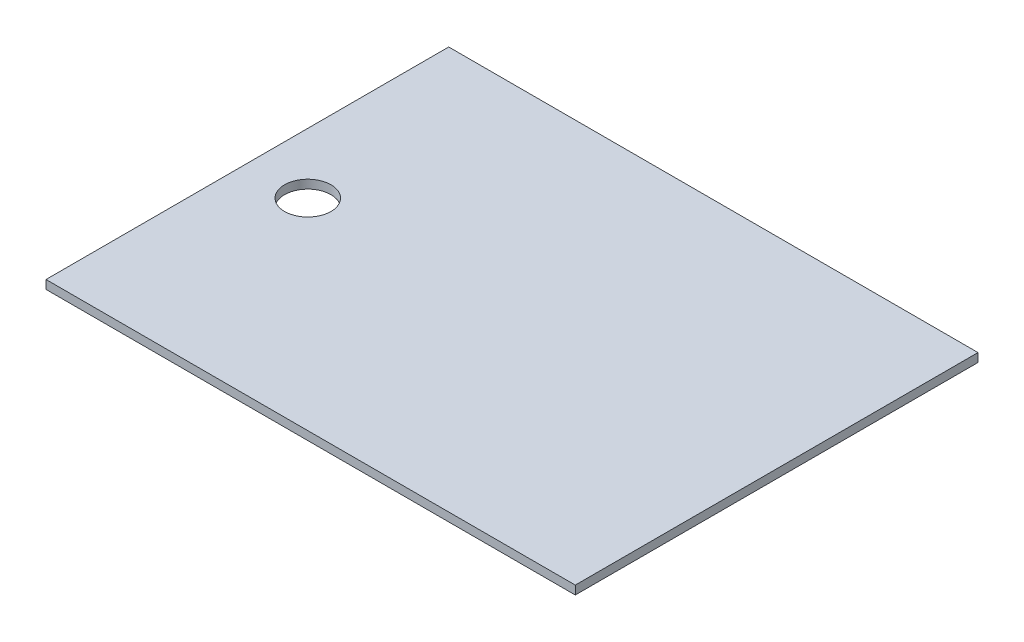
from build123d import *

# Parameters (mm, degrees)
SKETCH2_W           = 1168.4
SKETCH2_H           = 889
BOSS_EXTRUDE1_DEPTH = 19.05
SKETCH3_R           = 51.181
CUT_EXTRUDE1_DEPTH  = 735.324718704


with BuildPart() as part:
    # Sketch2 → Boss-Extrude1 (new body)
    with BuildSketch(Plane(origin=(0, 0, 0), x_dir=(1, 0, 0), z_dir=(0, 1, 0))):
        Rectangle(SKETCH2_W, SKETCH2_H)
    extrude(amount=BOSS_EXTRUDE1_DEPTH)

    # Sketch3 → Cut-Extrude1 (cut, through all)
    with BuildSketch(Plane(origin=(0, 19.05, 0), x_dir=(1, 0, 0), z_dir=(0, 1, 0))):
        with Locations(Location((-450.85, 0, 0), (0, 0, 270))):
            Circle(SKETCH3_R)
    extrude(amount=-CUT_EXTRUDE1_DEPTH, mode=Mode.SUBTRACT)


solid = part.part
